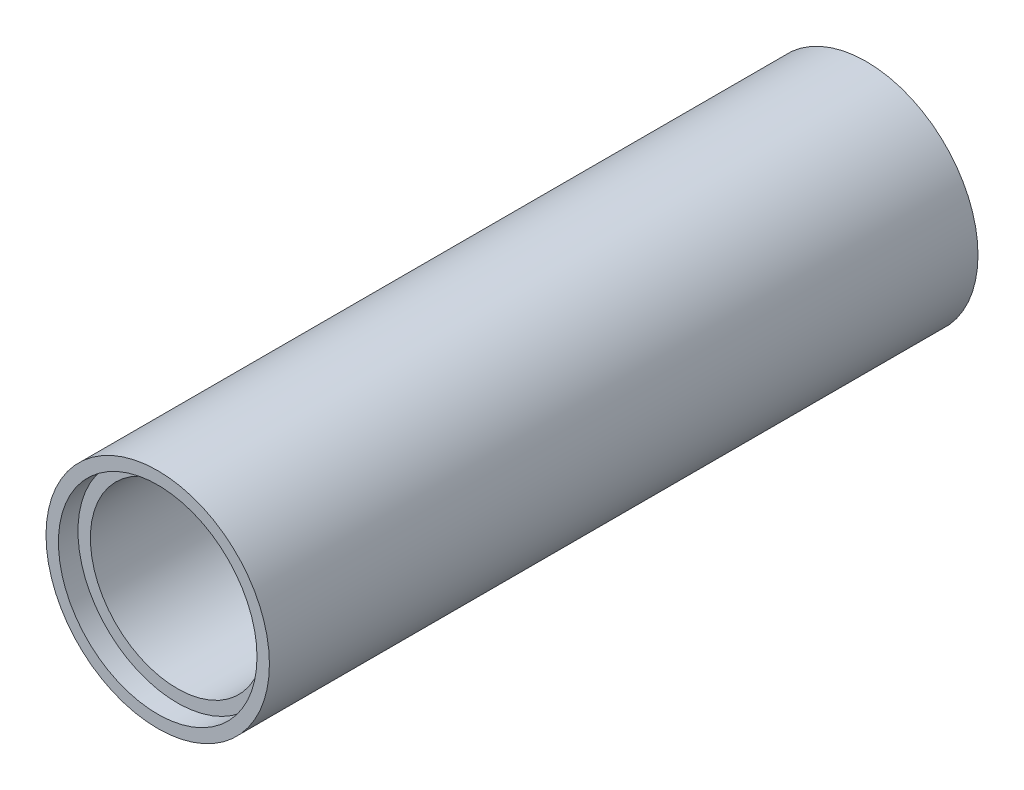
from build123d import *

# Parameters (mm, degrees)
SKETCH1_R           = 57.15
SKETCH1_R_2         = 44.45
BOSS_EXTRUDE1_DEPTH = 362.5
CUT_EXTRUDE1_START  = -10
SKETCH2_R           = 50.8
SKETCH2_R_2         = 44.45
CUT_EXTRUDE1_DEPTH  = 10


with BuildPart() as part:
    # Sketch1 → Boss-Extrude1 (new body)
    with BuildSketch(Plane.XY):
        Circle(SKETCH1_R)
        Circle(SKETCH1_R_2, mode=Mode.SUBTRACT)
    extrude(amount=BOSS_EXTRUDE1_DEPTH)

    # Sketch2 → Cut-Extrude1 (cut)
    with BuildSketch(Plane.XY.offset(362.5).offset(CUT_EXTRUDE1_START)):
        Circle(SKETCH2_R)
        Circle(SKETCH2_R_2, mode=Mode.SUBTRACT)
    extrude(amount=CUT_EXTRUDE1_DEPTH, mode=Mode.SUBTRACT)


solid = part.part
